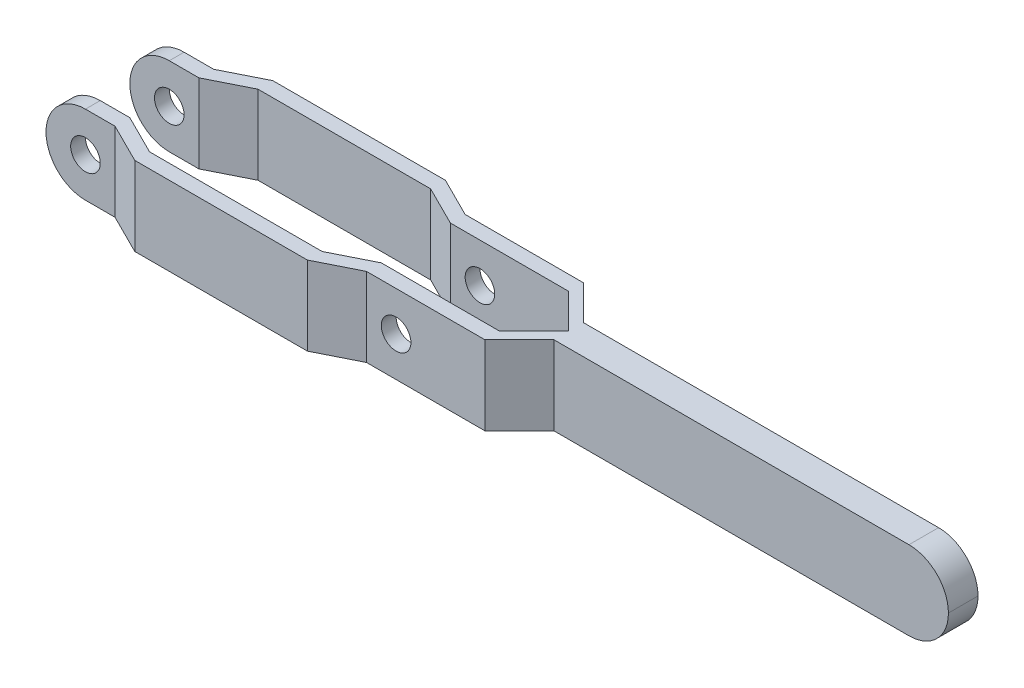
ISO-10303-21;
HEADER;
FILE_DESCRIPTION(('STEP AP214'),'2;1');
FILE_NAME('part.step','',(''),(''),'','','');
FILE_SCHEMA(('AUTOMOTIVE_DESIGN { 1 0 10303 214 1 1 1 1 }'));
ENDSEC;
DATA;
#1=APPLICATION_CONTEXT('core data for automotive mechanical design processes');
#2=APPLICATION_PROTOCOL_DEFINITION('international standard','automotive_design',2000,#1);
#3=PRODUCT_CONTEXT('',#1,'mechanical');
#4=PRODUCT('Part','Part','',(#3));
#5=PRODUCT_RELATED_PRODUCT_CATEGORY('part','',(#4));
#6=PRODUCT_DEFINITION_FORMATION('','',#4);
#7=PRODUCT_DEFINITION_CONTEXT('part definition',#1,'design');
#8=PRODUCT_DEFINITION('design','',#6,#7);
#9=PRODUCT_DEFINITION_SHAPE('','',#8);
#10=(LENGTH_UNIT() NAMED_UNIT(*) SI_UNIT(.MILLI.,.METRE.));
#11=(NAMED_UNIT(*) PLANE_ANGLE_UNIT() SI_UNIT($,.RADIAN.));
#12=(NAMED_UNIT(*) SI_UNIT($,.STERADIAN.) SOLID_ANGLE_UNIT());
#13=UNCERTAINTY_MEASURE_WITH_UNIT(LENGTH_MEASURE(1.E-05),#10,'distance_accuracy_value','');
#14=(GEOMETRIC_REPRESENTATION_CONTEXT(3) GLOBAL_UNCERTAINTY_ASSIGNED_CONTEXT((#13)) GLOBAL_UNIT_ASSIGNED_CONTEXT((#10,
#11,#12)) REPRESENTATION_CONTEXT('',''));
#15=CARTESIAN_POINT('',(0.,0.,0.));
#16=DIRECTION('',(0.,0.,1.));
#17=DIRECTION('',(1.,0.,0.));
#18=AXIS2_PLACEMENT_3D('',#15,#16,#17);
#19=CARTESIAN_POINT('',(80.,16.,-2.99999999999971));
#20=DIRECTION('',(0.,0.,1.));
#21=DIRECTION('',(1.,0.,0.));
#22=AXIS2_PLACEMENT_3D('',#19,#20,#21);
#23=PLANE('',#22);
#24=CARTESIAN_POINT('',(72.,8.,-2.99999999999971));
#25=DIRECTION('',(0.,0.,1.));
#26=DIRECTION('',(1.,0.,0.));
#27=AXIS2_PLACEMENT_3D('',#24,#25,#26);
#28=CIRCLE('',#27,8.);
#29=CARTESIAN_POINT('',(72.,16.,-2.99999999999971));
#30=VERTEX_POINT('',#29);
#31=CARTESIAN_POINT('',(80.,8.,-2.99999999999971));
#32=VERTEX_POINT('',#31);
#33=EDGE_CURVE('E260',#30,#32,#28,.F.);
#34=ORIENTED_EDGE('',*,*,#33,.T.);
#35=CARTESIAN_POINT('',(72.,8.,-2.99999999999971));
#36=DIRECTION('',(0.,0.,1.));
#37=DIRECTION('',(1.,0.,0.));
#38=AXIS2_PLACEMENT_3D('',#35,#36,#37);
#39=CIRCLE('',#38,8.);
#40=CARTESIAN_POINT('',(72.,0.,-2.99999999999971));
#41=VERTEX_POINT('',#40);
#42=EDGE_CURVE('E436',#32,#41,#39,.F.);
#43=ORIENTED_EDGE('',*,*,#42,.T.);
#44=DIRECTION('',(-1.,0.,0.));
#45=VECTOR('',#44,1.);
#46=CARTESIAN_POINT('',(80.,0.,-2.99999999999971));
#47=LINE('',#46,#45);
#48=CARTESIAN_POINT('',(0.,0.,-2.9999999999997));
#49=VERTEX_POINT('',#48);
#50=EDGE_CURVE('E257',#41,#49,#47,.T.);
#51=ORIENTED_EDGE('',*,*,#50,.T.);
#52=DIRECTION('',(0.,-1.,0.));
#53=VECTOR('',#52,1.);
#54=CARTESIAN_POINT('',(0.,16.,-2.9999999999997));
#55=LINE('',#54,#53);
#56=CARTESIAN_POINT('',(0.,16.,-2.9999999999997));
#57=VERTEX_POINT('',#56);
#58=EDGE_CURVE('E255',#57,#49,#55,.T.);
#59=ORIENTED_EDGE('',*,*,#58,.F.);
#60=DIRECTION('',(-1.,0.,0.));
#61=VECTOR('',#60,1.);
#62=CARTESIAN_POINT('',(80.,16.,-2.99999999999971));
#63=LINE('',#62,#61);
#64=EDGE_CURVE('E241',#30,#57,#63,.T.);
#65=ORIENTED_EDGE('',*,*,#64,.F.);
#66=EDGE_LOOP('',(#34,#43,#51,#59,#65));
#67=FACE_BOUND('',#66,.T.);
#68=ADVANCED_FACE('F33',(#67),#23,.F.);
#69=CARTESIAN_POINT('',(0.,16.,-2.9999999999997));
#70=DIRECTION('',(-0.707106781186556,0.,0.707106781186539));
#71=DIRECTION('',(0.707106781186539,0.,0.707106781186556));
#72=AXIS2_PLACEMENT_3D('',#69,#70,#71);
#73=PLANE('',#72);
#74=DIRECTION('',(-0.707106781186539,0.,-0.707106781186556));
#75=VECTOR('',#74,1.);
#76=CARTESIAN_POINT('',(0.,0.,-2.9999999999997));
#77=LINE('',#76,#75);
#78=CARTESIAN_POINT('',(-7.,0.,-9.99999999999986));
#79=VERTEX_POINT('',#78);
#80=EDGE_CURVE('E320',#49,#79,#77,.T.);
#81=ORIENTED_EDGE('',*,*,#80,.T.);
#82=DIRECTION('',(0.,-1.,0.));
#83=VECTOR('',#82,1.);
#84=CARTESIAN_POINT('',(-7.,16.,-9.99999999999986));
#85=LINE('',#84,#83);
#86=CARTESIAN_POINT('',(-7.,16.,-9.99999999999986));
#87=VERTEX_POINT('',#86);
#88=EDGE_CURVE('E261',#87,#79,#85,.T.);
#89=ORIENTED_EDGE('',*,*,#88,.F.);
#90=DIRECTION('',(-0.707106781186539,0.,-0.707106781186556));
#91=VECTOR('',#90,1.);
#92=CARTESIAN_POINT('',(0.,16.,-2.9999999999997));
#93=LINE('',#92,#91);
#94=EDGE_CURVE('E245',#57,#87,#93,.T.);
#95=ORIENTED_EDGE('',*,*,#94,.F.);
#96=ORIENTED_EDGE('',*,*,#58,.T.);
#97=EDGE_LOOP('',(#81,#89,#95,#96));
#98=FACE_BOUND('',#97,.T.);
#99=ADVANCED_FACE('F263',(#98),#73,.F.);
#100=CARTESIAN_POINT('',(-7.,16.,-9.99999999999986));
#101=DIRECTION('',(0.,0.,1.));
#102=DIRECTION('',(1.,0.,0.));
#103=AXIS2_PLACEMENT_3D('',#100,#101,#102);
#104=PLANE('',#103);
#105=CARTESIAN_POINT('',(-25.,8.,-9.99999999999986));
#106=DIRECTION('',(0.,0.,1.));
#107=DIRECTION('',(1.,0.,0.));
#108=AXIS2_PLACEMENT_3D('',#105,#106,#107);
#109=CIRCLE('',#108,3.);
#110=CARTESIAN_POINT('',(-22.,8.,-9.99999999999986));
#111=VERTEX_POINT('',#110);
#112=EDGE_CURVE('E478',#111,#111,#109,.T.);
#113=ORIENTED_EDGE('',*,*,#112,.T.);
#114=EDGE_LOOP('',(#113));
#115=FACE_BOUND('',#114,.T.);
#116=DIRECTION('',(-1.,0.,0.));
#117=VECTOR('',#116,1.);
#118=CARTESIAN_POINT('',(-7.,0.,-9.99999999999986));
#119=LINE('',#118,#117);
#120=CARTESIAN_POINT('',(-31.,0.,-9.99999999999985));
#121=VERTEX_POINT('',#120);
#122=EDGE_CURVE('E323',#79,#121,#119,.T.);
#123=ORIENTED_EDGE('',*,*,#122,.T.);
#124=DIRECTION('',(0.,-1.,0.));
#125=VECTOR('',#124,1.);
#126=CARTESIAN_POINT('',(-31.,16.,-9.99999999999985));
#127=LINE('',#126,#125);
#128=CARTESIAN_POINT('',(-31.,16.,-9.99999999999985));
#129=VERTEX_POINT('',#128);
#130=EDGE_CURVE('E431',#129,#121,#127,.T.);
#131=ORIENTED_EDGE('',*,*,#130,.F.);
#132=DIRECTION('',(-1.,0.,0.));
#133=VECTOR('',#132,1.);
#134=CARTESIAN_POINT('',(-7.,16.,-9.99999999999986));
#135=LINE('',#134,#133);
#136=EDGE_CURVE('E266',#87,#129,#135,.T.);
#137=ORIENTED_EDGE('',*,*,#136,.F.);
#138=ORIENTED_EDGE('',*,*,#88,.T.);
#139=EDGE_LOOP('',(#123,#131,#137,#138));
#140=FACE_BOUND('',#139,.T.);
#141=ADVANCED_FACE('F523',(#115,#140),#104,.F.);
#142=CARTESIAN_POINT('',(-31.,16.,-9.99999999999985));
#143=DIRECTION('',(-0.447213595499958,0.,0.894427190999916));
#144=DIRECTION('',(0.894427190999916,0.,0.447213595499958));
#145=AXIS2_PLACEMENT_3D('',#142,#143,#144);
#146=PLANE('',#145);
#147=DIRECTION('',(-0.894427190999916,0.,-0.447213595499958));
#148=VECTOR('',#147,1.);
#149=CARTESIAN_POINT('',(-31.,0.,-9.99999999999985));
#150=LINE('',#149,#148);
#151=CARTESIAN_POINT('',(-39.,0.,-13.9999999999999));
#152=VERTEX_POINT('',#151);
#153=EDGE_CURVE('E325',#121,#152,#150,.T.);
#154=ORIENTED_EDGE('',*,*,#153,.T.);
#155=DIRECTION('',(0.,-1.,0.));
#156=VECTOR('',#155,1.);
#157=CARTESIAN_POINT('',(-39.,16.,-13.9999999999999));
#158=LINE('',#157,#156);
#159=CARTESIAN_POINT('',(-39.,16.,-13.9999999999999));
#160=VERTEX_POINT('',#159);
#161=EDGE_CURVE('E428',#160,#152,#158,.T.);
#162=ORIENTED_EDGE('',*,*,#161,.F.);
#163=DIRECTION('',(-0.894427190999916,0.,-0.447213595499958));
#164=VECTOR('',#163,1.);
#165=CARTESIAN_POINT('',(-31.,16.,-9.99999999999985));
#166=LINE('',#165,#164);
#167=EDGE_CURVE('E268',#129,#160,#166,.T.);
#168=ORIENTED_EDGE('',*,*,#167,.F.);
#169=ORIENTED_EDGE('',*,*,#130,.T.);
#170=EDGE_LOOP('',(#154,#162,#168,#169));
#171=FACE_BOUND('',#170,.T.);
#172=ADVANCED_FACE('F638',(#171),#146,.F.);
#173=CARTESIAN_POINT('',(-39.,16.,-13.9999999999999));
#174=DIRECTION('',(0.,0.,1.));
#175=DIRECTION('',(1.,0.,0.));
#176=AXIS2_PLACEMENT_3D('',#173,#174,#175);
#177=PLANE('',#176);
#178=DIRECTION('',(-1.,0.,0.));
#179=VECTOR('',#178,1.);
#180=CARTESIAN_POINT('',(-39.,0.,-13.9999999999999));
#181=LINE('',#180,#179);
#182=CARTESIAN_POINT('',(-74.,0.,-13.9999999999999));
#183=VERTEX_POINT('',#182);
#184=EDGE_CURVE('E327',#152,#183,#181,.T.);
#185=ORIENTED_EDGE('',*,*,#184,.T.);
#186=DIRECTION('',(0.,-1.,0.));
#187=VECTOR('',#186,1.);
#188=CARTESIAN_POINT('',(-74.,16.,-13.9999999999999));
#189=LINE('',#188,#187);
#190=CARTESIAN_POINT('',(-74.,16.,-13.9999999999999));
#191=VERTEX_POINT('',#190);
#192=EDGE_CURVE('E425',#191,#183,#189,.T.);
#193=ORIENTED_EDGE('',*,*,#192,.F.);
#194=DIRECTION('',(-1.,0.,0.));
#195=VECTOR('',#194,1.);
#196=CARTESIAN_POINT('',(-39.,16.,-13.9999999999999));
#197=LINE('',#196,#195);
#198=EDGE_CURVE('E273',#160,#191,#197,.T.);
#199=ORIENTED_EDGE('',*,*,#198,.F.);
#200=ORIENTED_EDGE('',*,*,#161,.T.);
#201=EDGE_LOOP('',(#185,#193,#199,#200));
#202=FACE_BOUND('',#201,.T.);
#203=ADVANCED_FACE('F634',(#202),#177,.F.);
#204=CARTESIAN_POINT('',(-74.,16.,-13.9999999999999));
#205=DIRECTION('',(0.447213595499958,0.,0.894427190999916));
#206=DIRECTION('',(0.894427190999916,0.,-0.447213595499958));
#207=AXIS2_PLACEMENT_3D('',#204,#205,#206);
#208=PLANE('',#207);
#209=DIRECTION('',(-0.894427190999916,0.,0.447213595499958));
#210=VECTOR('',#209,1.);
#211=CARTESIAN_POINT('',(-74.,0.,-13.9999999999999));
#212=LINE('',#211,#210);
#213=CARTESIAN_POINT('',(-82.,0.,-9.99999999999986));
#214=VERTEX_POINT('',#213);
#215=EDGE_CURVE('E329',#183,#214,#212,.T.);
#216=ORIENTED_EDGE('',*,*,#215,.T.);
#217=DIRECTION('',(0.,-1.,0.));
#218=VECTOR('',#217,1.);
#219=CARTESIAN_POINT('',(-82.,16.,-9.99999999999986));
#220=LINE('',#219,#218);
#221=CARTESIAN_POINT('',(-82.,16.,-9.99999999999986));
#222=VERTEX_POINT('',#221);
#223=EDGE_CURVE('E422',#222,#214,#220,.T.);
#224=ORIENTED_EDGE('',*,*,#223,.F.);
#225=DIRECTION('',(-0.894427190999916,0.,0.447213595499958));
#226=VECTOR('',#225,1.);
#227=CARTESIAN_POINT('',(-74.,16.,-13.9999999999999));
#228=LINE('',#227,#226);
#229=EDGE_CURVE('E275',#191,#222,#228,.T.);
#230=ORIENTED_EDGE('',*,*,#229,.F.);
#231=ORIENTED_EDGE('',*,*,#192,.T.);
#232=EDGE_LOOP('',(#216,#224,#230,#231));
#233=FACE_BOUND('',#232,.T.);
#234=ADVANCED_FACE('F628',(#233),#208,.F.);
#235=CARTESIAN_POINT('',(-82.,16.,-9.99999999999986));
#236=DIRECTION('',(0.,0.,1.));
#237=DIRECTION('',(1.,0.,0.));
#238=AXIS2_PLACEMENT_3D('',#235,#236,#237);
#239=PLANE('',#238);
#240=CARTESIAN_POINT('',(-88.,8.,-9.99999999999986));
#241=DIRECTION('',(0.,0.,1.));
#242=DIRECTION('',(1.,0.,0.));
#243=AXIS2_PLACEMENT_3D('',#240,#241,#242);
#244=CIRCLE('',#243,3.00000000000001);
#245=CARTESIAN_POINT('',(-85.,8.,-9.99999999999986));
#246=VERTEX_POINT('',#245);
#247=EDGE_CURVE('E474',#246,#246,#244,.T.);
#248=ORIENTED_EDGE('',*,*,#247,.T.);
#249=EDGE_LOOP('',(#248));
#250=FACE_BOUND('',#249,.T.);
#251=DIRECTION('',(-1.,0.,0.));
#252=VECTOR('',#251,1.);
#253=CARTESIAN_POINT('',(-82.,0.,-9.99999999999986));
#254=LINE('',#253,#252);
#255=CARTESIAN_POINT('',(-88.,0.,-9.99999999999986));
#256=VERTEX_POINT('',#255);
#257=EDGE_CURVE('E331',#214,#256,#254,.T.);
#258=ORIENTED_EDGE('',*,*,#257,.T.);
#259=CARTESIAN_POINT('',(-88.,8.,-9.99999999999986));
#260=DIRECTION('',(0.,0.,1.));
#261=DIRECTION('',(1.,0.,0.));
#262=AXIS2_PLACEMENT_3D('',#259,#260,#261);
#263=CIRCLE('',#262,8.);
#264=CARTESIAN_POINT('',(-96.,8.,-9.99999999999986));
#265=VERTEX_POINT('',#264);
#266=EDGE_CURVE('E461',#256,#265,#263,.F.);
#267=ORIENTED_EDGE('',*,*,#266,.T.);
#268=CARTESIAN_POINT('',(-88.,8.,-9.99999999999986));
#269=DIRECTION('',(0.,0.,1.));
#270=DIRECTION('',(1.,0.,0.));
#271=AXIS2_PLACEMENT_3D('',#268,#269,#270);
#272=CIRCLE('',#271,8.);
#273=CARTESIAN_POINT('',(-88.,16.,-9.99999999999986));
#274=VERTEX_POINT('',#273);
#275=EDGE_CURVE('E459',#265,#274,#272,.F.);
#276=ORIENTED_EDGE('',*,*,#275,.T.);
#277=DIRECTION('',(-1.,0.,0.));
#278=VECTOR('',#277,1.);
#279=CARTESIAN_POINT('',(-82.,16.,-9.99999999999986));
#280=LINE('',#279,#278);
#281=EDGE_CURVE('E277',#222,#274,#280,.T.);
#282=ORIENTED_EDGE('',*,*,#281,.F.);
#283=ORIENTED_EDGE('',*,*,#223,.T.);
#284=EDGE_LOOP('',(#258,#267,#276,#282,#283));
#285=FACE_BOUND('',#284,.T.);
#286=ADVANCED_FACE('F498',(#250,#285),#239,.F.);
#287=CARTESIAN_POINT('',(-82.,16.,-7.));
#288=DIRECTION('',(0.,0.,-1.));
#289=DIRECTION('',(-1.,0.,0.));
#290=AXIS2_PLACEMENT_3D('',#287,#288,#289);
#291=PLANE('',#290);
#292=CARTESIAN_POINT('',(-88.,8.,-7.));
#293=DIRECTION('',(0.,0.,-1.));
#294=DIRECTION('',(-1.,0.,0.));
#295=AXIS2_PLACEMENT_3D('',#292,#293,#294);
#296=CIRCLE('',#295,3.00000000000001);
#297=CARTESIAN_POINT('',(-91.,8.,-6.99999999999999));
#298=VERTEX_POINT('',#297);
#299=EDGE_CURVE('E482',#298,#298,#296,.T.);
#300=ORIENTED_EDGE('',*,*,#299,.T.);
#301=EDGE_LOOP('',(#300));
#302=FACE_BOUND('',#301,.T.);
#303=CARTESIAN_POINT('',(-88.,8.,-7.));
#304=DIRECTION('',(0.,0.,-1.));
#305=DIRECTION('',(-1.,0.,0.));
#306=AXIS2_PLACEMENT_3D('',#303,#304,#305);
#307=CIRCLE('',#306,8.);
#308=CARTESIAN_POINT('',(-88.,16.,-7.));
#309=VERTEX_POINT('',#308);
#310=CARTESIAN_POINT('',(-96.,8.,-6.99999999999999));
#311=VERTEX_POINT('',#310);
#312=EDGE_CURVE('E446',#309,#311,#307,.F.);
#313=ORIENTED_EDGE('',*,*,#312,.T.);
#314=CARTESIAN_POINT('',(-88.,8.,-7.));
#315=DIRECTION('',(0.,0.,-1.));
#316=DIRECTION('',(-1.,0.,0.));
#317=AXIS2_PLACEMENT_3D('',#314,#315,#316);
#318=CIRCLE('',#317,8.);
#319=CARTESIAN_POINT('',(-88.,0.,-7.));
#320=VERTEX_POINT('',#319);
#321=EDGE_CURVE('E451',#311,#320,#318,.F.);
#322=ORIENTED_EDGE('',*,*,#321,.T.);
#323=DIRECTION('',(1.,0.,0.));
#324=VECTOR('',#323,1.);
#325=CARTESIAN_POINT('',(-82.,0.,-7.));
#326=LINE('',#325,#324);
#327=CARTESIAN_POINT('',(-82.,0.,-7.));
#328=VERTEX_POINT('',#327);
#329=EDGE_CURVE('E334',#320,#328,#326,.T.);
#330=ORIENTED_EDGE('',*,*,#329,.T.);
#331=DIRECTION('',(0.,-1.,0.));
#332=VECTOR('',#331,1.);
#333=CARTESIAN_POINT('',(-82.,16.,-7.));
#334=LINE('',#333,#332);
#335=CARTESIAN_POINT('',(-82.,16.,-7.));
#336=VERTEX_POINT('',#335);
#337=EDGE_CURVE('E419',#336,#328,#334,.T.);
#338=ORIENTED_EDGE('',*,*,#337,.F.);
#339=DIRECTION('',(1.,0.,0.));
#340=VECTOR('',#339,1.);
#341=CARTESIAN_POINT('',(-82.,16.,-7.));
#342=LINE('',#341,#340);
#343=EDGE_CURVE('E280',#309,#336,#342,.T.);
#344=ORIENTED_EDGE('',*,*,#343,.F.);
#345=EDGE_LOOP('',(#313,#322,#330,#338,#344));
#346=FACE_BOUND('',#345,.T.);
#347=ADVANCED_FACE('F619',(#302,#346),#291,.F.);
#348=CARTESIAN_POINT('',(-74.,16.,-11.));
#349=DIRECTION('',(-0.447213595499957,0.,-0.894427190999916));
#350=DIRECTION('',(-0.894427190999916,0.,0.447213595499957));
#351=AXIS2_PLACEMENT_3D('',#348,#349,#350);
#352=PLANE('',#351);
#353=DIRECTION('',(0.894427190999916,0.,-0.447213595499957));
#354=VECTOR('',#353,1.);
#355=CARTESIAN_POINT('',(-74.,0.,-11.));
#356=LINE('',#355,#354);
#357=CARTESIAN_POINT('',(-74.,0.,-11.));
#358=VERTEX_POINT('',#357);
#359=EDGE_CURVE('E336',#328,#358,#356,.T.);
#360=ORIENTED_EDGE('',*,*,#359,.T.);
#361=DIRECTION('',(0.,-1.,0.));
#362=VECTOR('',#361,1.);
#363=CARTESIAN_POINT('',(-74.,16.,-11.));
#364=LINE('',#363,#362);
#365=CARTESIAN_POINT('',(-74.,16.,-11.));
#366=VERTEX_POINT('',#365);
#367=EDGE_CURVE('E416',#366,#358,#364,.T.);
#368=ORIENTED_EDGE('',*,*,#367,.F.);
#369=DIRECTION('',(0.894427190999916,0.,-0.447213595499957));
#370=VECTOR('',#369,1.);
#371=CARTESIAN_POINT('',(-74.,16.,-11.));
#372=LINE('',#371,#370);
#373=EDGE_CURVE('E282',#336,#366,#372,.T.);
#374=ORIENTED_EDGE('',*,*,#373,.F.);
#375=ORIENTED_EDGE('',*,*,#337,.T.);
#376=EDGE_LOOP('',(#360,#368,#374,#375));
#377=FACE_BOUND('',#376,.T.);
#378=ADVANCED_FACE('F607',(#377),#352,.F.);
#379=CARTESIAN_POINT('',(-39.,16.,-11.));
#380=DIRECTION('',(0.,0.,-1.));
#381=DIRECTION('',(-1.,0.,0.));
#382=AXIS2_PLACEMENT_3D('',#379,#380,#381);
#383=PLANE('',#382);
#384=DIRECTION('',(1.,0.,0.));
#385=VECTOR('',#384,1.);
#386=CARTESIAN_POINT('',(-39.,0.,-11.));
#387=LINE('',#386,#385);
#388=CARTESIAN_POINT('',(-39.,0.,-11.));
#389=VERTEX_POINT('',#388);
#390=EDGE_CURVE('E338',#358,#389,#387,.T.);
#391=ORIENTED_EDGE('',*,*,#390,.T.);
#392=DIRECTION('',(0.,-1.,0.));
#393=VECTOR('',#392,1.);
#394=CARTESIAN_POINT('',(-39.,16.,-11.));
#395=LINE('',#394,#393);
#396=CARTESIAN_POINT('',(-39.,16.,-11.));
#397=VERTEX_POINT('',#396);
#398=EDGE_CURVE('E413',#397,#389,#395,.T.);
#399=ORIENTED_EDGE('',*,*,#398,.F.);
#400=DIRECTION('',(1.,0.,0.));
#401=VECTOR('',#400,1.);
#402=CARTESIAN_POINT('',(-39.,16.,-11.));
#403=LINE('',#402,#401);
#404=EDGE_CURVE('E284',#366,#397,#403,.T.);
#405=ORIENTED_EDGE('',*,*,#404,.F.);
#406=ORIENTED_EDGE('',*,*,#367,.T.);
#407=EDGE_LOOP('',(#391,#399,#405,#406));
#408=FACE_BOUND('',#407,.T.);
#409=ADVANCED_FACE('F603',(#408),#383,.F.);
#410=CARTESIAN_POINT('',(-31.,16.,-7.));
#411=DIRECTION('',(0.447213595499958,0.,-0.894427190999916));
#412=DIRECTION('',(-0.894427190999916,0.,-0.447213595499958));
#413=AXIS2_PLACEMENT_3D('',#410,#411,#412);
#414=PLANE('',#413);
#415=DIRECTION('',(0.894427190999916,0.,0.447213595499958));
#416=VECTOR('',#415,1.);
#417=CARTESIAN_POINT('',(-31.,0.,-7.));
#418=LINE('',#417,#416);
#419=CARTESIAN_POINT('',(-31.,0.,-7.));
#420=VERTEX_POINT('',#419);
#421=EDGE_CURVE('E340',#389,#420,#418,.T.);
#422=ORIENTED_EDGE('',*,*,#421,.T.);
#423=DIRECTION('',(0.,-1.,0.));
#424=VECTOR('',#423,1.);
#425=CARTESIAN_POINT('',(-31.,16.,-7.));
#426=LINE('',#425,#424);
#427=CARTESIAN_POINT('',(-31.,16.,-7.));
#428=VERTEX_POINT('',#427);
#429=EDGE_CURVE('E410',#428,#420,#426,.T.);
#430=ORIENTED_EDGE('',*,*,#429,.F.);
#431=DIRECTION('',(0.894427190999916,0.,0.447213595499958));
#432=VECTOR('',#431,1.);
#433=CARTESIAN_POINT('',(-31.,16.,-7.));
#434=LINE('',#433,#432);
#435=EDGE_CURVE('E286',#397,#428,#434,.T.);
#436=ORIENTED_EDGE('',*,*,#435,.F.);
#437=ORIENTED_EDGE('',*,*,#398,.T.);
#438=EDGE_LOOP('',(#422,#430,#436,#437));
#439=FACE_BOUND('',#438,.T.);
#440=ADVANCED_FACE('F598',(#439),#414,.F.);
#441=CARTESIAN_POINT('',(-7.,16.,-7.));
#442=DIRECTION('',(0.,0.,-1.));
#443=DIRECTION('',(-1.,0.,0.));
#444=AXIS2_PLACEMENT_3D('',#441,#442,#443);
#445=PLANE('',#444);
#446=CARTESIAN_POINT('',(-25.,8.,-7.));
#447=DIRECTION('',(0.,0.,-1.));
#448=DIRECTION('',(-1.,0.,0.));
#449=AXIS2_PLACEMENT_3D('',#446,#447,#448);
#450=CIRCLE('',#449,3.);
#451=CARTESIAN_POINT('',(-28.,8.,-7.));
#452=VERTEX_POINT('',#451);
#453=EDGE_CURVE('E485',#452,#452,#450,.T.);
#454=ORIENTED_EDGE('',*,*,#453,.T.);
#455=EDGE_LOOP('',(#454));
#456=FACE_BOUND('',#455,.T.);
#457=DIRECTION('',(1.,0.,0.));
#458=VECTOR('',#457,1.);
#459=CARTESIAN_POINT('',(-7.,0.,-7.));
#460=LINE('',#459,#458);
#461=CARTESIAN_POINT('',(-7.,0.,-7.));
#462=VERTEX_POINT('',#461);
#463=EDGE_CURVE('E342',#420,#462,#460,.T.);
#464=ORIENTED_EDGE('',*,*,#463,.T.);
#465=DIRECTION('',(0.,-1.,0.));
#466=VECTOR('',#465,1.);
#467=CARTESIAN_POINT('',(-7.,16.,-7.));
#468=LINE('',#467,#466);
#469=CARTESIAN_POINT('',(-7.,16.,-7.));
#470=VERTEX_POINT('',#469);
#471=EDGE_CURVE('E407',#470,#462,#468,.T.);
#472=ORIENTED_EDGE('',*,*,#471,.F.);
#473=DIRECTION('',(1.,0.,0.));
#474=VECTOR('',#473,1.);
#475=CARTESIAN_POINT('',(-7.,16.,-7.));
#476=LINE('',#475,#474);
#477=EDGE_CURVE('E288',#428,#470,#476,.T.);
#478=ORIENTED_EDGE('',*,*,#477,.F.);
#479=ORIENTED_EDGE('',*,*,#429,.T.);
#480=EDGE_LOOP('',(#464,#472,#478,#479));
#481=FACE_BOUND('',#480,.T.);
#482=ADVANCED_FACE('F592',(#456,#481),#445,.F.);
#483=CARTESIAN_POINT('',(0.,16.,0.));
#484=DIRECTION('',(0.707106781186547,0.,-0.707106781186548));
#485=DIRECTION('',(-0.707106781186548,0.,-0.707106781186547));
#486=AXIS2_PLACEMENT_3D('',#483,#484,#485);
#487=PLANE('',#486);
#488=DIRECTION('',(0.707106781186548,0.,0.707106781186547));
#489=VECTOR('',#488,1.);
#490=CARTESIAN_POINT('',(0.,0.,0.));
#491=LINE('',#490,#489);
#492=CARTESIAN_POINT('',(0.,0.,0.));
#493=VERTEX_POINT('',#492);
#494=EDGE_CURVE('E344',#462,#493,#491,.T.);
#495=ORIENTED_EDGE('',*,*,#494,.T.);
#496=DIRECTION('',(0.,-1.,0.));
#497=VECTOR('',#496,1.);
#498=CARTESIAN_POINT('',(0.,16.,0.));
#499=LINE('',#498,#497);
#500=CARTESIAN_POINT('',(0.,16.,0.));
#501=VERTEX_POINT('',#500);
#502=EDGE_CURVE('E404',#501,#493,#499,.T.);
#503=ORIENTED_EDGE('',*,*,#502,.F.);
#504=DIRECTION('',(0.707106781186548,0.,0.707106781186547));
#505=VECTOR('',#504,1.);
#506=CARTESIAN_POINT('',(0.,16.,0.));
#507=LINE('',#506,#505);
#508=EDGE_CURVE('E290',#470,#501,#507,.T.);
#509=ORIENTED_EDGE('',*,*,#508,.F.);
#510=ORIENTED_EDGE('',*,*,#471,.T.);
#511=EDGE_LOOP('',(#495,#503,#509,#510));
#512=FACE_BOUND('',#511,.T.);
#513=ADVANCED_FACE('F588',(#512),#487,.F.);
#514=CARTESIAN_POINT('',(0.,16.,0.));
#515=DIRECTION('',(0.707106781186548,0.,0.707106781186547));
#516=DIRECTION('',(0.707106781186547,0.,-0.707106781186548));
#517=AXIS2_PLACEMENT_3D('',#514,#515,#516);
#518=PLANE('',#517);
#519=DIRECTION('',(-0.707106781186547,0.,0.707106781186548));
#520=VECTOR('',#519,1.);
#521=CARTESIAN_POINT('',(0.,0.,0.));
#522=LINE('',#521,#520);
#523=CARTESIAN_POINT('',(-6.99999999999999,0.,7.));
#524=VERTEX_POINT('',#523);
#525=EDGE_CURVE('E346',#493,#524,#522,.T.);
#526=ORIENTED_EDGE('',*,*,#525,.T.);
#527=DIRECTION('',(0.,-1.,0.));
#528=VECTOR('',#527,1.);
#529=CARTESIAN_POINT('',(-6.99999999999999,16.,7.));
#530=LINE('',#529,#528);
#531=CARTESIAN_POINT('',(-6.99999999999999,16.,7.));
#532=VERTEX_POINT('',#531);
#533=EDGE_CURVE('E401',#532,#524,#530,.T.);
#534=ORIENTED_EDGE('',*,*,#533,.F.);
#535=DIRECTION('',(-0.707106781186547,0.,0.707106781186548));
#536=VECTOR('',#535,1.);
#537=CARTESIAN_POINT('',(0.,16.,0.));
#538=LINE('',#537,#536);
#539=EDGE_CURVE('E292',#501,#532,#538,.T.);
#540=ORIENTED_EDGE('',*,*,#539,.F.);
#541=ORIENTED_EDGE('',*,*,#502,.T.);
#542=EDGE_LOOP('',(#526,#534,#540,#541));
#543=FACE_BOUND('',#542,.T.);
#544=ADVANCED_FACE('F583',(#543),#518,.F.);
#545=CARTESIAN_POINT('',(-6.99999999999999,16.,7.));
#546=DIRECTION('',(0.,0.,1.));
#547=DIRECTION('',(1.,0.,0.));
#548=AXIS2_PLACEMENT_3D('',#545,#546,#547);
#549=PLANE('',#548);
#550=CARTESIAN_POINT('',(-25.,8.,7.));
#551=DIRECTION('',(0.,0.,1.));
#552=DIRECTION('',(1.,0.,0.));
#553=AXIS2_PLACEMENT_3D('',#550,#551,#552);
#554=CIRCLE('',#553,3.);
#555=CARTESIAN_POINT('',(-22.,8.,7.));
#556=VERTEX_POINT('',#555);
#557=EDGE_CURVE('E490',#556,#556,#554,.T.);
#558=ORIENTED_EDGE('',*,*,#557,.T.);
#559=EDGE_LOOP('',(#558));
#560=FACE_BOUND('',#559,.T.);
#561=DIRECTION('',(-1.,0.,0.));
#562=VECTOR('',#561,1.);
#563=CARTESIAN_POINT('',(-6.99999999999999,0.,7.));
#564=LINE('',#563,#562);
#565=CARTESIAN_POINT('',(-31.,0.,7.));
#566=VERTEX_POINT('',#565);
#567=EDGE_CURVE('E348',#524,#566,#564,.T.);
#568=ORIENTED_EDGE('',*,*,#567,.T.);
#569=DIRECTION('',(0.,-1.,0.));
#570=VECTOR('',#569,1.);
#571=CARTESIAN_POINT('',(-31.,16.,7.));
#572=LINE('',#571,#570);
#573=CARTESIAN_POINT('',(-31.,16.,7.));
#574=VERTEX_POINT('',#573);
#575=EDGE_CURVE('E398',#574,#566,#572,.T.);
#576=ORIENTED_EDGE('',*,*,#575,.F.);
#577=DIRECTION('',(-1.,0.,0.));
#578=VECTOR('',#577,1.);
#579=CARTESIAN_POINT('',(-6.99999999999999,16.,7.));
#580=LINE('',#579,#578);
#581=EDGE_CURVE('E294',#532,#574,#580,.T.);
#582=ORIENTED_EDGE('',*,*,#581,.F.);
#583=ORIENTED_EDGE('',*,*,#533,.T.);
#584=EDGE_LOOP('',(#568,#576,#582,#583));
#585=FACE_BOUND('',#584,.T.);
#586=ADVANCED_FACE('F577',(#560,#585),#549,.F.);
#587=CARTESIAN_POINT('',(-31.,16.,7.));
#588=DIRECTION('',(0.447213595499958,0.,0.894427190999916));
#589=DIRECTION('',(0.894427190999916,0.,-0.447213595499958));
#590=AXIS2_PLACEMENT_3D('',#587,#588,#589);
#591=PLANE('',#590);
#592=DIRECTION('',(-0.894427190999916,0.,0.447213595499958));
#593=VECTOR('',#592,1.);
#594=CARTESIAN_POINT('',(-31.,0.,7.));
#595=LINE('',#594,#593);
#596=CARTESIAN_POINT('',(-39.,0.,11.));
#597=VERTEX_POINT('',#596);
#598=EDGE_CURVE('E350',#566,#597,#595,.T.);
#599=ORIENTED_EDGE('',*,*,#598,.T.);
#600=DIRECTION('',(0.,-1.,0.));
#601=VECTOR('',#600,1.);
#602=CARTESIAN_POINT('',(-39.,16.,11.));
#603=LINE('',#602,#601);
#604=CARTESIAN_POINT('',(-39.,16.,11.));
#605=VERTEX_POINT('',#604);
#606=EDGE_CURVE('E395',#605,#597,#603,.T.);
#607=ORIENTED_EDGE('',*,*,#606,.F.);
#608=DIRECTION('',(-0.894427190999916,0.,0.447213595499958));
#609=VECTOR('',#608,1.);
#610=CARTESIAN_POINT('',(-31.,16.,7.));
#611=LINE('',#610,#609);
#612=EDGE_CURVE('E296',#574,#605,#611,.T.);
#613=ORIENTED_EDGE('',*,*,#612,.F.);
#614=ORIENTED_EDGE('',*,*,#575,.T.);
#615=EDGE_LOOP('',(#599,#607,#613,#614));
#616=FACE_BOUND('',#615,.T.);
#617=ADVANCED_FACE('F573',(#616),#591,.F.);
#618=CARTESIAN_POINT('',(-39.,16.,11.));
#619=DIRECTION('',(0.,0.,1.));
#620=DIRECTION('',(1.,0.,0.));
#621=AXIS2_PLACEMENT_3D('',#618,#619,#620);
#622=PLANE('',#621);
#623=DIRECTION('',(-1.,0.,0.));
#624=VECTOR('',#623,1.);
#625=CARTESIAN_POINT('',(-39.,0.,11.));
#626=LINE('',#625,#624);
#627=CARTESIAN_POINT('',(-74.,0.,11.));
#628=VERTEX_POINT('',#627);
#629=EDGE_CURVE('E352',#597,#628,#626,.T.);
#630=ORIENTED_EDGE('',*,*,#629,.T.);
#631=DIRECTION('',(0.,-1.,0.));
#632=VECTOR('',#631,1.);
#633=CARTESIAN_POINT('',(-74.,16.,11.));
#634=LINE('',#633,#632);
#635=CARTESIAN_POINT('',(-74.,16.,11.));
#636=VERTEX_POINT('',#635);
#637=EDGE_CURVE('E392',#636,#628,#634,.T.);
#638=ORIENTED_EDGE('',*,*,#637,.F.);
#639=DIRECTION('',(-1.,0.,0.));
#640=VECTOR('',#639,1.);
#641=CARTESIAN_POINT('',(-39.,16.,11.));
#642=LINE('',#641,#640);
#643=EDGE_CURVE('E298',#605,#636,#642,.T.);
#644=ORIENTED_EDGE('',*,*,#643,.F.);
#645=ORIENTED_EDGE('',*,*,#606,.T.);
#646=EDGE_LOOP('',(#630,#638,#644,#645));
#647=FACE_BOUND('',#646,.T.);
#648=ADVANCED_FACE('F568',(#647),#622,.F.);
#649=CARTESIAN_POINT('',(-74.,16.,11.));
#650=DIRECTION('',(-0.447213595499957,0.,0.894427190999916));
#651=DIRECTION('',(0.894427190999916,0.,0.447213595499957));
#652=AXIS2_PLACEMENT_3D('',#649,#650,#651);
#653=PLANE('',#652);
#654=DIRECTION('',(-0.894427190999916,0.,-0.447213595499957));
#655=VECTOR('',#654,1.);
#656=CARTESIAN_POINT('',(-74.,0.,11.));
#657=LINE('',#656,#655);
#658=CARTESIAN_POINT('',(-82.,0.,7.));
#659=VERTEX_POINT('',#658);
#660=EDGE_CURVE('E354',#628,#659,#657,.T.);
#661=ORIENTED_EDGE('',*,*,#660,.T.);
#662=DIRECTION('',(0.,-1.,0.));
#663=VECTOR('',#662,1.);
#664=CARTESIAN_POINT('',(-82.,16.,7.));
#665=LINE('',#664,#663);
#666=CARTESIAN_POINT('',(-82.,16.,7.));
#667=VERTEX_POINT('',#666);
#668=EDGE_CURVE('E389',#667,#659,#665,.T.);
#669=ORIENTED_EDGE('',*,*,#668,.F.);
#670=DIRECTION('',(-0.894427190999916,0.,-0.447213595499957));
#671=VECTOR('',#670,1.);
#672=CARTESIAN_POINT('',(-74.,16.,11.));
#673=LINE('',#672,#671);
#674=EDGE_CURVE('E300',#636,#667,#673,.T.);
#675=ORIENTED_EDGE('',*,*,#674,.F.);
#676=ORIENTED_EDGE('',*,*,#637,.T.);
#677=EDGE_LOOP('',(#661,#669,#675,#676));
#678=FACE_BOUND('',#677,.T.);
#679=ADVANCED_FACE('F562',(#678),#653,.F.);
#680=CARTESIAN_POINT('',(-82.,16.,7.));
#681=DIRECTION('',(0.,0.,1.));
#682=DIRECTION('',(1.,0.,0.));
#683=AXIS2_PLACEMENT_3D('',#680,#681,#682);
#684=PLANE('',#683);
#685=CARTESIAN_POINT('',(-88.,8.,7.));
#686=DIRECTION('',(0.,0.,1.));
#687=DIRECTION('',(1.,0.,0.));
#688=AXIS2_PLACEMENT_3D('',#685,#686,#687);
#689=CIRCLE('',#688,3.00000000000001);
#690=CARTESIAN_POINT('',(-85.,8.,7.));
#691=VERTEX_POINT('',#690);
#692=EDGE_CURVE('E477',#691,#691,#689,.T.);
#693=ORIENTED_EDGE('',*,*,#692,.T.);
#694=EDGE_LOOP('',(#693));
#695=FACE_BOUND('',#694,.T.);
#696=DIRECTION('',(-1.,0.,0.));
#697=VECTOR('',#696,1.);
#698=CARTESIAN_POINT('',(-82.,0.,7.));
#699=LINE('',#698,#697);
#700=CARTESIAN_POINT('',(-88.,0.,7.00000000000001));
#701=VERTEX_POINT('',#700);
#702=EDGE_CURVE('E356',#659,#701,#699,.T.);
#703=ORIENTED_EDGE('',*,*,#702,.T.);
#704=CARTESIAN_POINT('',(-88.,8.,7.00000000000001));
#705=DIRECTION('',(0.,0.,1.));
#706=DIRECTION('',(1.,0.,0.));
#707=AXIS2_PLACEMENT_3D('',#704,#705,#706);
#708=CIRCLE('',#707,8.);
#709=CARTESIAN_POINT('',(-96.,8.,7.00000000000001));
#710=VERTEX_POINT('',#709);
#711=EDGE_CURVE('E55',#701,#710,#708,.F.);
#712=ORIENTED_EDGE('',*,*,#711,.T.);
#713=CARTESIAN_POINT('',(-88.,8.,7.00000000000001));
#714=DIRECTION('',(0.,0.,1.));
#715=DIRECTION('',(1.,0.,0.));
#716=AXIS2_PLACEMENT_3D('',#713,#714,#715);
#717=CIRCLE('',#716,8.);
#718=CARTESIAN_POINT('',(-88.,16.,7.00000000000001));
#719=VERTEX_POINT('',#718);
#720=EDGE_CURVE('E50',#710,#719,#717,.F.);
#721=ORIENTED_EDGE('',*,*,#720,.T.);
#722=DIRECTION('',(-1.,0.,0.));
#723=VECTOR('',#722,1.);
#724=CARTESIAN_POINT('',(-82.,16.,7.));
#725=LINE('',#724,#723);
#726=EDGE_CURVE('E302',#667,#719,#725,.T.);
#727=ORIENTED_EDGE('',*,*,#726,.F.);
#728=ORIENTED_EDGE('',*,*,#668,.T.);
#729=EDGE_LOOP('',(#703,#712,#721,#727,#728));
#730=FACE_BOUND('',#729,.T.);
#731=ADVANCED_FACE('F558',(#695,#730),#684,.F.);
#732=CARTESIAN_POINT('',(-82.,16.,9.99999999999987));
#733=DIRECTION('',(0.,0.,-1.));
#734=DIRECTION('',(-1.,0.,0.));
#735=AXIS2_PLACEMENT_3D('',#732,#733,#734);
#736=PLANE('',#735);
#737=CARTESIAN_POINT('',(-88.,8.,9.99999999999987));
#738=DIRECTION('',(0.,0.,-1.));
#739=DIRECTION('',(-1.,0.,0.));
#740=AXIS2_PLACEMENT_3D('',#737,#738,#739);
#741=CIRCLE('',#740,3.00000000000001);
#742=CARTESIAN_POINT('',(-91.,8.,9.99999999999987));
#743=VERTEX_POINT('',#742);
#744=EDGE_CURVE('E475',#743,#743,#741,.T.);
#745=ORIENTED_EDGE('',*,*,#744,.T.);
#746=EDGE_LOOP('',(#745));
#747=FACE_BOUND('',#746,.T.);
#748=CARTESIAN_POINT('',(-88.,8.,9.99999999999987));
#749=DIRECTION('',(0.,0.,-1.));
#750=DIRECTION('',(-1.,0.,0.));
#751=AXIS2_PLACEMENT_3D('',#748,#749,#750);
#752=CIRCLE('',#751,8.);
#753=CARTESIAN_POINT('',(-88.,16.,9.99999999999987));
#754=VERTEX_POINT('',#753);
#755=CARTESIAN_POINT('',(-96.,8.,9.99999999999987));
#756=VERTEX_POINT('',#755);
#757=EDGE_CURVE('E463',#754,#756,#752,.F.);
#758=ORIENTED_EDGE('',*,*,#757,.T.);
#759=CARTESIAN_POINT('',(-88.,8.,9.99999999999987));
#760=DIRECTION('',(0.,0.,-1.));
#761=DIRECTION('',(-1.,0.,0.));
#762=AXIS2_PLACEMENT_3D('',#759,#760,#761);
#763=CIRCLE('',#762,8.);
#764=CARTESIAN_POINT('',(-88.,0.,9.99999999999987));
#765=VERTEX_POINT('',#764);
#766=EDGE_CURVE('E465',#756,#765,#763,.F.);
#767=ORIENTED_EDGE('',*,*,#766,.T.);
#768=DIRECTION('',(1.,0.,0.));
#769=VECTOR('',#768,1.);
#770=CARTESIAN_POINT('',(-82.,0.,9.99999999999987));
#771=LINE('',#770,#769);
#772=CARTESIAN_POINT('',(-82.,0.,9.99999999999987));
#773=VERTEX_POINT('',#772);
#774=EDGE_CURVE('E358',#765,#773,#771,.T.);
#775=ORIENTED_EDGE('',*,*,#774,.T.);
#776=DIRECTION('',(0.,-1.,0.));
#777=VECTOR('',#776,1.);
#778=CARTESIAN_POINT('',(-82.,16.,9.99999999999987));
#779=LINE('',#778,#777);
#780=CARTESIAN_POINT('',(-82.,16.,9.99999999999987));
#781=VERTEX_POINT('',#780);
#782=EDGE_CURVE('E386',#781,#773,#779,.T.);
#783=ORIENTED_EDGE('',*,*,#782,.F.);
#784=DIRECTION('',(1.,0.,0.));
#785=VECTOR('',#784,1.);
#786=CARTESIAN_POINT('',(-82.,16.,9.99999999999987));
#787=LINE('',#786,#785);
#788=EDGE_CURVE('E304',#754,#781,#787,.T.);
#789=ORIENTED_EDGE('',*,*,#788,.F.);
#790=EDGE_LOOP('',(#758,#767,#775,#783,#789));
#791=FACE_BOUND('',#790,.T.);
#792=ADVANCED_FACE('F692',(#747,#791),#736,.F.);
#793=CARTESIAN_POINT('',(-74.,16.,13.9999999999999));
#794=DIRECTION('',(0.447213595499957,0.,-0.894427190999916));
#795=DIRECTION('',(-0.894427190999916,0.,-0.447213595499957));
#796=AXIS2_PLACEMENT_3D('',#793,#794,#795);
#797=PLANE('',#796);
#798=DIRECTION('',(0.894427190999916,0.,0.447213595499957));
#799=VECTOR('',#798,1.);
#800=CARTESIAN_POINT('',(-74.,0.,13.9999999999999));
#801=LINE('',#800,#799);
#802=CARTESIAN_POINT('',(-74.,0.,13.9999999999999));
#803=VERTEX_POINT('',#802);
#804=EDGE_CURVE('E360',#773,#803,#801,.T.);
#805=ORIENTED_EDGE('',*,*,#804,.T.);
#806=DIRECTION('',(0.,-1.,0.));
#807=VECTOR('',#806,1.);
#808=CARTESIAN_POINT('',(-74.,16.,13.9999999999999));
#809=LINE('',#808,#807);
#810=CARTESIAN_POINT('',(-74.,16.,13.9999999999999));
#811=VERTEX_POINT('',#810);
#812=EDGE_CURVE('E383',#811,#803,#809,.T.);
#813=ORIENTED_EDGE('',*,*,#812,.F.);
#814=DIRECTION('',(0.894427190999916,0.,0.447213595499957));
#815=VECTOR('',#814,1.);
#816=CARTESIAN_POINT('',(-74.,16.,13.9999999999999));
#817=LINE('',#816,#815);
#818=EDGE_CURVE('E306',#781,#811,#817,.T.);
#819=ORIENTED_EDGE('',*,*,#818,.F.);
#820=ORIENTED_EDGE('',*,*,#782,.T.);
#821=EDGE_LOOP('',(#805,#813,#819,#820));
#822=FACE_BOUND('',#821,.T.);
#823=ADVANCED_FACE('F688',(#822),#797,.F.);
#824=CARTESIAN_POINT('',(-39.,16.,13.9999999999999));
#825=DIRECTION('',(0.,0.,-1.));
#826=DIRECTION('',(-1.,0.,0.));
#827=AXIS2_PLACEMENT_3D('',#824,#825,#826);
#828=PLANE('',#827);
#829=DIRECTION('',(1.,0.,0.));
#830=VECTOR('',#829,1.);
#831=CARTESIAN_POINT('',(-39.,0.,13.9999999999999));
#832=LINE('',#831,#830);
#833=CARTESIAN_POINT('',(-39.,0.,13.9999999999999));
#834=VERTEX_POINT('',#833);
#835=EDGE_CURVE('E362',#803,#834,#832,.T.);
#836=ORIENTED_EDGE('',*,*,#835,.T.);
#837=DIRECTION('',(0.,-1.,0.));
#838=VECTOR('',#837,1.);
#839=CARTESIAN_POINT('',(-39.,16.,13.9999999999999));
#840=LINE('',#839,#838);
#841=CARTESIAN_POINT('',(-39.,16.,13.9999999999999));
#842=VERTEX_POINT('',#841);
#843=EDGE_CURVE('E380',#842,#834,#840,.T.);
#844=ORIENTED_EDGE('',*,*,#843,.F.);
#845=DIRECTION('',(1.,0.,0.));
#846=VECTOR('',#845,1.);
#847=CARTESIAN_POINT('',(-39.,16.,13.9999999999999));
#848=LINE('',#847,#846);
#849=EDGE_CURVE('E308',#811,#842,#848,.T.);
#850=ORIENTED_EDGE('',*,*,#849,.F.);
#851=ORIENTED_EDGE('',*,*,#812,.T.);
#852=EDGE_LOOP('',(#836,#844,#850,#851));
#853=FACE_BOUND('',#852,.T.);
#854=ADVANCED_FACE('F683',(#853),#828,.F.);
#855=CARTESIAN_POINT('',(-31.,16.,9.99999999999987));
#856=DIRECTION('',(-0.447213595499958,0.,-0.894427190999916));
#857=DIRECTION('',(-0.894427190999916,0.,0.447213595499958));
#858=AXIS2_PLACEMENT_3D('',#855,#856,#857);
#859=PLANE('',#858);
#860=DIRECTION('',(0.894427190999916,0.,-0.447213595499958));
#861=VECTOR('',#860,1.);
#862=CARTESIAN_POINT('',(-31.,0.,9.99999999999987));
#863=LINE('',#862,#861);
#864=CARTESIAN_POINT('',(-31.,0.,9.99999999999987));
#865=VERTEX_POINT('',#864);
#866=EDGE_CURVE('E364',#834,#865,#863,.T.);
#867=ORIENTED_EDGE('',*,*,#866,.T.);
#868=DIRECTION('',(0.,-1.,0.));
#869=VECTOR('',#868,1.);
#870=CARTESIAN_POINT('',(-31.,16.,9.99999999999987));
#871=LINE('',#870,#869);
#872=CARTESIAN_POINT('',(-31.,16.,9.99999999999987));
#873=VERTEX_POINT('',#872);
#874=EDGE_CURVE('E377',#873,#865,#871,.T.);
#875=ORIENTED_EDGE('',*,*,#874,.F.);
#876=DIRECTION('',(0.894427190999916,0.,-0.447213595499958));
#877=VECTOR('',#876,1.);
#878=CARTESIAN_POINT('',(-31.,16.,9.99999999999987));
#879=LINE('',#878,#877);
#880=EDGE_CURVE('E310',#842,#873,#879,.T.);
#881=ORIENTED_EDGE('',*,*,#880,.F.);
#882=ORIENTED_EDGE('',*,*,#843,.T.);
#883=EDGE_LOOP('',(#867,#875,#881,#882));
#884=FACE_BOUND('',#883,.T.);
#885=ADVANCED_FACE('F679',(#884),#859,.F.);
#886=CARTESIAN_POINT('',(-6.99999999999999,16.,9.99999999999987));
#887=DIRECTION('',(0.,0.,-1.));
#888=DIRECTION('',(-1.,0.,0.));
#889=AXIS2_PLACEMENT_3D('',#886,#887,#888);
#890=PLANE('',#889);
#891=CARTESIAN_POINT('',(-25.,8.,9.99999999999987));
#892=DIRECTION('',(0.,0.,-1.));
#893=DIRECTION('',(-1.,0.,0.));
#894=AXIS2_PLACEMENT_3D('',#891,#892,#893);
#895=CIRCLE('',#894,3.);
#896=CARTESIAN_POINT('',(-28.,8.,9.99999999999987));
#897=VERTEX_POINT('',#896);
#898=EDGE_CURVE('E37',#897,#897,#895,.T.);
#899=ORIENTED_EDGE('',*,*,#898,.T.);
#900=EDGE_LOOP('',(#899));
#901=FACE_BOUND('',#900,.T.);
#902=DIRECTION('',(1.,0.,0.));
#903=VECTOR('',#902,1.);
#904=CARTESIAN_POINT('',(-6.99999999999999,0.,9.99999999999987));
#905=LINE('',#904,#903);
#906=CARTESIAN_POINT('',(-6.99999999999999,0.,9.99999999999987));
#907=VERTEX_POINT('',#906);
#908=EDGE_CURVE('E366',#865,#907,#905,.T.);
#909=ORIENTED_EDGE('',*,*,#908,.T.);
#910=DIRECTION('',(0.,-1.,0.));
#911=VECTOR('',#910,1.);
#912=CARTESIAN_POINT('',(-6.99999999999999,16.,9.99999999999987));
#913=LINE('',#912,#911);
#914=CARTESIAN_POINT('',(-6.99999999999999,16.,9.99999999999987));
#915=VERTEX_POINT('',#914);
#916=EDGE_CURVE('E374',#915,#907,#913,.T.);
#917=ORIENTED_EDGE('',*,*,#916,.F.);
#918=DIRECTION('',(1.,0.,0.));
#919=VECTOR('',#918,1.);
#920=CARTESIAN_POINT('',(-6.99999999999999,16.,9.99999999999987));
#921=LINE('',#920,#919);
#922=EDGE_CURVE('E312',#873,#915,#921,.T.);
#923=ORIENTED_EDGE('',*,*,#922,.F.);
#924=ORIENTED_EDGE('',*,*,#874,.T.);
#925=EDGE_LOOP('',(#909,#917,#923,#924));
#926=FACE_BOUND('',#925,.T.);
#927=ADVANCED_FACE('F675',(#901,#926),#890,.F.);
#928=CARTESIAN_POINT('',(0.,16.,2.99999999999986));
#929=DIRECTION('',(-0.707106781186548,0.,-0.707106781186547));
#930=DIRECTION('',(-0.707106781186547,0.,0.707106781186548));
#931=AXIS2_PLACEMENT_3D('',#928,#929,#930);
#932=PLANE('',#931);
#933=DIRECTION('',(0.707106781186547,0.,-0.707106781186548));
#934=VECTOR('',#933,1.);
#935=CARTESIAN_POINT('',(0.,0.,2.99999999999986));
#936=LINE('',#935,#934);
#937=CARTESIAN_POINT('',(0.,0.,2.99999999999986));
#938=VERTEX_POINT('',#937);
#939=EDGE_CURVE('E368',#907,#938,#936,.T.);
#940=ORIENTED_EDGE('',*,*,#939,.T.);
#941=DIRECTION('',(0.,-1.,0.));
#942=VECTOR('',#941,1.);
#943=CARTESIAN_POINT('',(0.,16.,2.99999999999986));
#944=LINE('',#943,#942);
#945=CARTESIAN_POINT('',(0.,16.,2.99999999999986));
#946=VERTEX_POINT('',#945);
#947=EDGE_CURVE('E318',#946,#938,#944,.T.);
#948=ORIENTED_EDGE('',*,*,#947,.F.);
#949=DIRECTION('',(0.707106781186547,0.,-0.707106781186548));
#950=VECTOR('',#949,1.);
#951=CARTESIAN_POINT('',(0.,16.,2.99999999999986));
#952=LINE('',#951,#950);
#953=EDGE_CURVE('E314',#915,#946,#952,.T.);
#954=ORIENTED_EDGE('',*,*,#953,.F.);
#955=ORIENTED_EDGE('',*,*,#916,.T.);
#956=EDGE_LOOP('',(#940,#948,#954,#955));
#957=FACE_BOUND('',#956,.T.);
#958=ADVANCED_FACE('F670',(#957),#932,.F.);
#959=CARTESIAN_POINT('',(80.,16.,2.99999999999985));
#960=DIRECTION('',(0.,0.,-1.));
#961=DIRECTION('',(-1.,0.,0.));
#962=AXIS2_PLACEMENT_3D('',#959,#960,#961);
#963=PLANE('',#962);
#964=DIRECTION('',(1.,0.,0.));
#965=VECTOR('',#964,1.);
#966=CARTESIAN_POINT('',(80.,0.,2.99999999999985));
#967=LINE('',#966,#965);
#968=CARTESIAN_POINT('',(72.,0.,2.99999999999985));
#969=VERTEX_POINT('',#968);
#970=EDGE_CURVE('E252',#938,#969,#967,.T.);
#971=ORIENTED_EDGE('',*,*,#970,.T.);
#972=CARTESIAN_POINT('',(72.,8.,2.99999999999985));
#973=DIRECTION('',(0.,0.,-1.));
#974=DIRECTION('',(-1.,0.,0.));
#975=AXIS2_PLACEMENT_3D('',#972,#973,#974);
#976=CIRCLE('',#975,8.);
#977=CARTESIAN_POINT('',(80.,8.,2.99999999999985));
#978=VERTEX_POINT('',#977);
#979=EDGE_CURVE('E443',#969,#978,#976,.F.);
#980=ORIENTED_EDGE('',*,*,#979,.T.);
#981=CARTESIAN_POINT('',(72.,8.,2.99999999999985));
#982=DIRECTION('',(0.,0.,-1.));
#983=DIRECTION('',(-1.,0.,0.));
#984=AXIS2_PLACEMENT_3D('',#981,#982,#983);
#985=CIRCLE('',#984,8.);
#986=CARTESIAN_POINT('',(72.,16.,2.99999999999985));
#987=VERTEX_POINT('',#986);
#988=EDGE_CURVE('E441',#978,#987,#985,.F.);
#989=ORIENTED_EDGE('',*,*,#988,.T.);
#990=DIRECTION('',(1.,0.,0.));
#991=VECTOR('',#990,1.);
#992=CARTESIAN_POINT('',(80.,16.,2.99999999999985));
#993=LINE('',#992,#991);
#994=EDGE_CURVE('E316',#946,#987,#993,.T.);
#995=ORIENTED_EDGE('',*,*,#994,.F.);
#996=ORIENTED_EDGE('',*,*,#947,.T.);
#997=EDGE_LOOP('',(#971,#980,#989,#995,#996));
#998=FACE_BOUND('',#997,.T.);
#999=ADVANCED_FACE('F663',(#998),#963,.F.);
#1000=CARTESIAN_POINT('',(0.,16.,0.));
#1001=DIRECTION('',(0.,-1.,0.));
#1002=DIRECTION('',(0.,0.,-1.));
#1003=AXIS2_PLACEMENT_3D('',#1000,#1001,#1002);
#1004=PLANE('',#1003);
#1005=ORIENTED_EDGE('',*,*,#726,.T.);
#1006=DIRECTION('',(0.,0.,1.));
#1007=VECTOR('',#1006,1.);
#1008=CARTESIAN_POINT('',(-87.9999999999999,16.,-8.14163551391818E-13));
#1009=LINE('',#1008,#1007);
#1010=EDGE_CURVE('E11',#719,#754,#1009,.T.);
#1011=ORIENTED_EDGE('',*,*,#1010,.T.);
#1012=ORIENTED_EDGE('',*,*,#788,.T.);
#1013=ORIENTED_EDGE('',*,*,#818,.T.);
#1014=ORIENTED_EDGE('',*,*,#849,.T.);
#1015=ORIENTED_EDGE('',*,*,#880,.T.);
#1016=ORIENTED_EDGE('',*,*,#922,.T.);
#1017=ORIENTED_EDGE('',*,*,#953,.T.);
#1018=ORIENTED_EDGE('',*,*,#994,.T.);
#1019=DIRECTION('',(0.,0.,-1.));
#1020=VECTOR('',#1019,1.);
#1021=CARTESIAN_POINT('',(72.,16.,0.));
#1022=LINE('',#1021,#1020);
#1023=EDGE_CURVE('E249',#987,#30,#1022,.T.);
#1024=ORIENTED_EDGE('',*,*,#1023,.T.);
#1025=ORIENTED_EDGE('',*,*,#64,.T.);
#1026=ORIENTED_EDGE('',*,*,#94,.T.);
#1027=ORIENTED_EDGE('',*,*,#136,.T.);
#1028=ORIENTED_EDGE('',*,*,#167,.T.);
#1029=ORIENTED_EDGE('',*,*,#198,.T.);
#1030=ORIENTED_EDGE('',*,*,#229,.T.);
#1031=ORIENTED_EDGE('',*,*,#281,.T.);
#1032=DIRECTION('',(0.,0.,1.));
#1033=VECTOR('',#1032,1.);
#1034=CARTESIAN_POINT('',(-88.,16.,0.));
#1035=LINE('',#1034,#1033);
#1036=EDGE_CURVE('E42',#274,#309,#1035,.T.);
#1037=ORIENTED_EDGE('',*,*,#1036,.T.);
#1038=ORIENTED_EDGE('',*,*,#343,.T.);
#1039=ORIENTED_EDGE('',*,*,#373,.T.);
#1040=ORIENTED_EDGE('',*,*,#404,.T.);
#1041=ORIENTED_EDGE('',*,*,#435,.T.);
#1042=ORIENTED_EDGE('',*,*,#477,.T.);
#1043=ORIENTED_EDGE('',*,*,#508,.T.);
#1044=ORIENTED_EDGE('',*,*,#539,.T.);
#1045=ORIENTED_EDGE('',*,*,#581,.T.);
#1046=ORIENTED_EDGE('',*,*,#612,.T.);
#1047=ORIENTED_EDGE('',*,*,#643,.T.);
#1048=ORIENTED_EDGE('',*,*,#674,.T.);
#1049=EDGE_LOOP('',(#1005,#1011,#1012,#1013,#1014,#1015,#1016,#1017,#1018,#1024,#1025,#1026,
#1027,#1028,#1029,#1030,#1031,#1037,#1038,#1039,#1040,#1041,#1042,#1043,#1044,#1045,#1046,#1047,#1048));
#1050=FACE_BOUND('',#1049,.T.);
#1051=ADVANCED_FACE('F243',(#1050),#1004,.F.);
#1052=CARTESIAN_POINT('',(0.,0.,0.));
#1053=DIRECTION('',(0.,-1.,0.));
#1054=DIRECTION('',(0.,0.,-1.));
#1055=AXIS2_PLACEMENT_3D('',#1052,#1053,#1054);
#1056=PLANE('',#1055);
#1057=ORIENTED_EDGE('',*,*,#329,.F.);
#1058=DIRECTION('',(0.,0.,1.));
#1059=VECTOR('',#1058,1.);
#1060=CARTESIAN_POINT('',(-88.,0.,-9.99999999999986));
#1061=LINE('',#1060,#1059);
#1062=EDGE_CURVE('E456',#320,#256,#1061,.F.);
#1063=ORIENTED_EDGE('',*,*,#1062,.T.);
#1064=ORIENTED_EDGE('',*,*,#257,.F.);
#1065=ORIENTED_EDGE('',*,*,#215,.F.);
#1066=ORIENTED_EDGE('',*,*,#184,.F.);
#1067=ORIENTED_EDGE('',*,*,#153,.F.);
#1068=ORIENTED_EDGE('',*,*,#122,.F.);
#1069=ORIENTED_EDGE('',*,*,#80,.F.);
#1070=ORIENTED_EDGE('',*,*,#50,.F.);
#1071=DIRECTION('',(0.,0.,-1.));
#1072=VECTOR('',#1071,1.);
#1073=CARTESIAN_POINT('',(72.,0.,2.99999999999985));
#1074=LINE('',#1073,#1072);
#1075=EDGE_CURVE('E438',#41,#969,#1074,.F.);
#1076=ORIENTED_EDGE('',*,*,#1075,.T.);
#1077=ORIENTED_EDGE('',*,*,#970,.F.);
#1078=ORIENTED_EDGE('',*,*,#939,.F.);
#1079=ORIENTED_EDGE('',*,*,#908,.F.);
#1080=ORIENTED_EDGE('',*,*,#866,.F.);
#1081=ORIENTED_EDGE('',*,*,#835,.F.);
#1082=ORIENTED_EDGE('',*,*,#804,.F.);
#1083=ORIENTED_EDGE('',*,*,#774,.F.);
#1084=DIRECTION('',(0.,0.,1.));
#1085=VECTOR('',#1084,1.);
#1086=CARTESIAN_POINT('',(-88.,0.,7.00000000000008));
#1087=LINE('',#1086,#1085);
#1088=EDGE_CURVE('E453',#765,#701,#1087,.F.);
#1089=ORIENTED_EDGE('',*,*,#1088,.T.);
#1090=ORIENTED_EDGE('',*,*,#702,.F.);
#1091=ORIENTED_EDGE('',*,*,#660,.F.);
#1092=ORIENTED_EDGE('',*,*,#629,.F.);
#1093=ORIENTED_EDGE('',*,*,#598,.F.);
#1094=ORIENTED_EDGE('',*,*,#567,.F.);
#1095=ORIENTED_EDGE('',*,*,#525,.F.);
#1096=ORIENTED_EDGE('',*,*,#494,.F.);
#1097=ORIENTED_EDGE('',*,*,#463,.F.);
#1098=ORIENTED_EDGE('',*,*,#421,.F.);
#1099=ORIENTED_EDGE('',*,*,#390,.F.);
#1100=ORIENTED_EDGE('',*,*,#359,.F.);
#1101=EDGE_LOOP('',(#1057,#1063,#1064,#1065,#1066,#1067,#1068,#1069,#1070,#1076,#1077,#1078,
#1079,#1080,#1081,#1082,#1083,#1089,#1090,#1091,#1092,#1093,#1094,#1095,#1096,#1097,#1098,#1099,#1100));
#1102=FACE_BOUND('',#1101,.T.);
#1103=ADVANCED_FACE('F535',(#1102),#1056,.T.);
#1104=CARTESIAN_POINT('',(72.,8.,0.));
#1105=DIRECTION('',(0.,0.,-1.));
#1106=DIRECTION('',(-1.,0.,0.));
#1107=AXIS2_PLACEMENT_3D('',#1104,#1105,#1106);
#1108=CYLINDRICAL_SURFACE('',#1107,8.);
#1109=ORIENTED_EDGE('',*,*,#1023,.F.);
#1110=ORIENTED_EDGE('',*,*,#988,.F.);
#1111=DIRECTION('',(0.,0.,-1.));
#1112=VECTOR('',#1111,1.);
#1113=CARTESIAN_POINT('',(80.,8.,-2.99999999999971));
#1114=LINE('',#1113,#1112);
#1115=EDGE_CURVE('E321',#32,#978,#1114,.F.);
#1116=ORIENTED_EDGE('',*,*,#1115,.F.);
#1117=ORIENTED_EDGE('',*,*,#33,.F.);
#1118=EDGE_LOOP('',(#1109,#1110,#1116,#1117));
#1119=FACE_BOUND('',#1118,.T.);
#1120=ADVANCED_FACE('F531',(#1119),#1108,.T.);
#1121=CARTESIAN_POINT('',(72.,8.,-2.99999999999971));
#1122=DIRECTION('',(0.,0.,1.));
#1123=DIRECTION('',(1.,0.,0.));
#1124=AXIS2_PLACEMENT_3D('',#1121,#1122,#1123);
#1125=CYLINDRICAL_SURFACE('',#1124,8.);
#1126=ORIENTED_EDGE('',*,*,#979,.F.);
#1127=ORIENTED_EDGE('',*,*,#1075,.F.);
#1128=ORIENTED_EDGE('',*,*,#42,.F.);
#1129=ORIENTED_EDGE('',*,*,#1115,.T.);
#1130=EDGE_LOOP('',(#1126,#1127,#1128,#1129));
#1131=FACE_BOUND('',#1130,.T.);
#1132=ADVANCED_FACE('F527',(#1131),#1125,.T.);
#1133=CARTESIAN_POINT('',(-88.,8.,0.));
#1134=DIRECTION('',(0.,0.,1.));
#1135=DIRECTION('',(1.,0.,0.));
#1136=AXIS2_PLACEMENT_3D('',#1133,#1134,#1135);
#1137=CYLINDRICAL_SURFACE('',#1136,8.);
#1138=ORIENTED_EDGE('',*,*,#1036,.F.);
#1139=ORIENTED_EDGE('',*,*,#275,.F.);
#1140=DIRECTION('',(0.,0.,1.));
#1141=VECTOR('',#1140,1.);
#1142=CARTESIAN_POINT('',(-96.,8.,-9.99999999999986));
#1143=LINE('',#1142,#1141);
#1144=EDGE_CURVE('E449',#311,#265,#1143,.F.);
#1145=ORIENTED_EDGE('',*,*,#1144,.F.);
#1146=ORIENTED_EDGE('',*,*,#312,.F.);
#1147=EDGE_LOOP('',(#1138,#1139,#1145,#1146));
#1148=FACE_BOUND('',#1147,.T.);
#1149=ADVANCED_FACE('F530',(#1148),#1137,.T.);
#1150=CARTESIAN_POINT('',(-88.,8.,-9.99999999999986));
#1151=DIRECTION('',(0.,0.,-1.));
#1152=DIRECTION('',(-1.,0.,0.));
#1153=AXIS2_PLACEMENT_3D('',#1150,#1151,#1152);
#1154=CYLINDRICAL_SURFACE('',#1153,8.);
#1155=ORIENTED_EDGE('',*,*,#266,.F.);
#1156=ORIENTED_EDGE('',*,*,#1062,.F.);
#1157=ORIENTED_EDGE('',*,*,#321,.F.);
#1158=ORIENTED_EDGE('',*,*,#1144,.T.);
#1159=EDGE_LOOP('',(#1155,#1156,#1157,#1158));
#1160=FACE_BOUND('',#1159,.T.);
#1161=ADVANCED_FACE('F537',(#1160),#1154,.T.);
#1162=CARTESIAN_POINT('',(-87.9999999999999,8.,-8.14163551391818E-13));
#1163=DIRECTION('',(0.,0.,1.));
#1164=DIRECTION('',(1.,0.,0.));
#1165=AXIS2_PLACEMENT_3D('',#1162,#1163,#1164);
#1166=CYLINDRICAL_SURFACE('',#1165,8.);
#1167=ORIENTED_EDGE('',*,*,#1010,.F.);
#1168=ORIENTED_EDGE('',*,*,#720,.F.);
#1169=DIRECTION('',(0.,0.,1.));
#1170=VECTOR('',#1169,1.);
#1171=CARTESIAN_POINT('',(-96.,8.,7.00000000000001));
#1172=LINE('',#1171,#1170);
#1173=EDGE_CURVE('E472',#756,#710,#1172,.F.);
#1174=ORIENTED_EDGE('',*,*,#1173,.F.);
#1175=ORIENTED_EDGE('',*,*,#757,.F.);
#1176=EDGE_LOOP('',(#1167,#1168,#1174,#1175));
#1177=FACE_BOUND('',#1176,.T.);
#1178=ADVANCED_FACE('F35',(#1177),#1166,.T.);
#1179=CARTESIAN_POINT('',(-88.,8.,7.00000000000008));
#1180=DIRECTION('',(0.,0.,-1.));
#1181=DIRECTION('',(-1.,0.,0.));
#1182=AXIS2_PLACEMENT_3D('',#1179,#1180,#1181);
#1183=CYLINDRICAL_SURFACE('',#1182,8.);
#1184=ORIENTED_EDGE('',*,*,#711,.F.);
#1185=ORIENTED_EDGE('',*,*,#1088,.F.);
#1186=ORIENTED_EDGE('',*,*,#766,.F.);
#1187=ORIENTED_EDGE('',*,*,#1173,.T.);
#1188=EDGE_LOOP('',(#1184,#1185,#1186,#1187));
#1189=FACE_BOUND('',#1188,.T.);
#1190=ADVANCED_FACE('F514',(#1189),#1183,.T.);
#1191=CARTESIAN_POINT('',(-88.,8.,-13.9999999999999));
#1192=DIRECTION('',(0.,0.,1.));
#1193=DIRECTION('',(1.,0.,0.));
#1194=AXIS2_PLACEMENT_3D('',#1191,#1192,#1193);
#1195=CYLINDRICAL_SURFACE('',#1194,3.00000000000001);
#1196=ORIENTED_EDGE('',*,*,#744,.F.);
#1197=EDGE_LOOP('',(#1196));
#1198=FACE_BOUND('',#1197,.T.);
#1199=ORIENTED_EDGE('',*,*,#692,.F.);
#1200=EDGE_LOOP('',(#1199));
#1201=FACE_BOUND('',#1200,.T.);
#1202=ADVANCED_FACE('F504',(#1198,#1201),#1195,.F.);
#1203=ORIENTED_EDGE('',*,*,#299,.F.);
#1204=EDGE_LOOP('',(#1203));
#1205=FACE_BOUND('',#1204,.T.);
#1206=ORIENTED_EDGE('',*,*,#247,.F.);
#1207=EDGE_LOOP('',(#1206));
#1208=FACE_BOUND('',#1207,.T.);
#1209=ADVANCED_FACE('F501',(#1205,#1208),#1195,.F.);
#1210=CARTESIAN_POINT('',(-25.,8.,-13.9999999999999));
#1211=DIRECTION('',(0.,0.,1.));
#1212=DIRECTION('',(1.,0.,0.));
#1213=AXIS2_PLACEMENT_3D('',#1210,#1211,#1212);
#1214=CYLINDRICAL_SURFACE('',#1213,3.);
#1215=ORIENTED_EDGE('',*,*,#898,.F.);
#1216=EDGE_LOOP('',(#1215));
#1217=FACE_BOUND('',#1216,.T.);
#1218=ORIENTED_EDGE('',*,*,#557,.F.);
#1219=EDGE_LOOP('',(#1218));
#1220=FACE_BOUND('',#1219,.T.);
#1221=ADVANCED_FACE('F503',(#1217,#1220),#1214,.F.);
#1222=ORIENTED_EDGE('',*,*,#453,.F.);
#1223=EDGE_LOOP('',(#1222));
#1224=FACE_BOUND('',#1223,.T.);
#1225=ORIENTED_EDGE('',*,*,#112,.F.);
#1226=EDGE_LOOP('',(#1225));
#1227=FACE_BOUND('',#1226,.T.);
#1228=ADVANCED_FACE('F511',(#1224,#1227),#1214,.F.);
#1229=CLOSED_SHELL('',(#68,#99,#141,#172,#203,#234,#286,#347,#378,#409,#440,#482,#513,#544,#586,
#617,#648,#679,#731,#792,#823,#854,#885,#927,#958,#999,#1051,#1103,#1120,#1132,#1149,#1161,
#1178,#1190,#1202,#1209,#1221,#1228));
#1230=MANIFOLD_SOLID_BREP('B2',#1229);
#1231=ADVANCED_BREP_SHAPE_REPRESENTATION('',(#18,#1230),#14);
#1232=SHAPE_DEFINITION_REPRESENTATION(#9,#1231);
ENDSEC;
END-ISO-10303-21;
